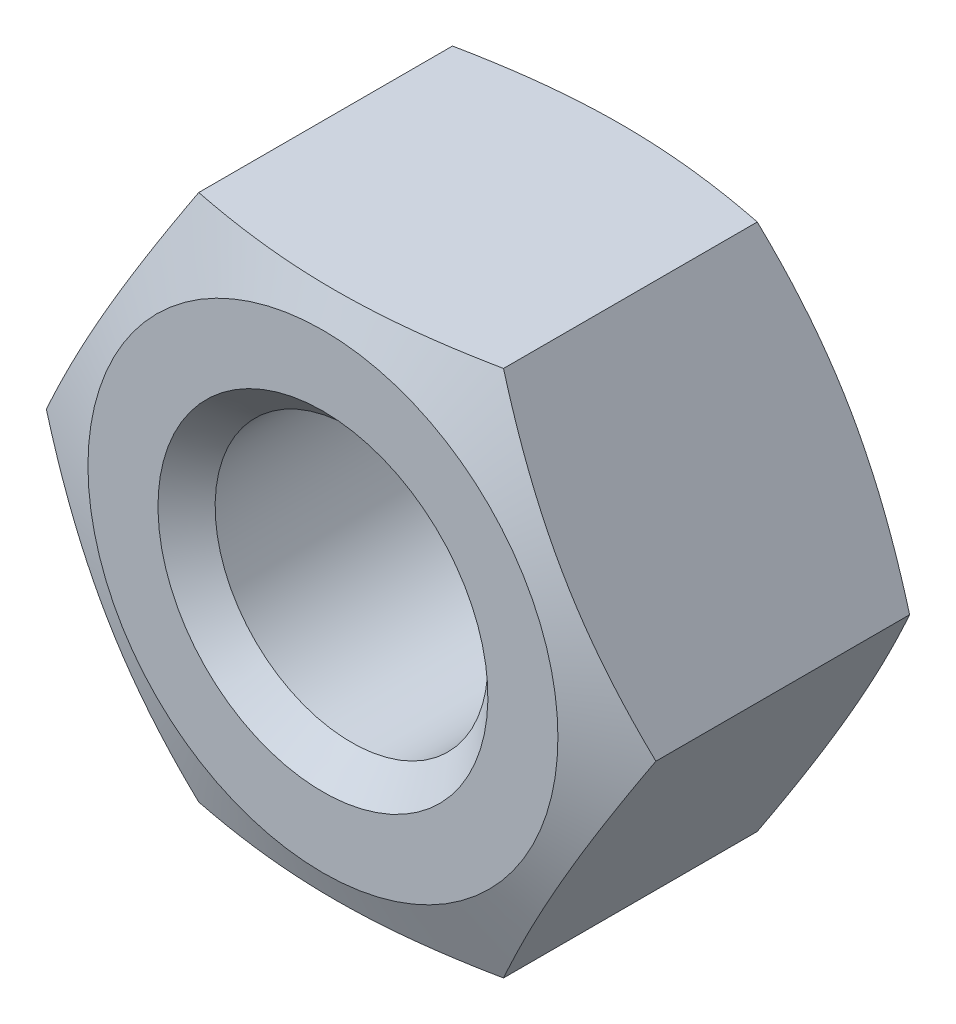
ISO-10303-21;
HEADER;
FILE_DESCRIPTION(('STEP AP214'),'2;1');
FILE_NAME('part.step','',(''),(''),'','','');
FILE_SCHEMA(('AUTOMOTIVE_DESIGN { 1 0 10303 214 1 1 1 1 }'));
ENDSEC;
DATA;
#1=APPLICATION_CONTEXT('core data for automotive mechanical design processes');
#2=APPLICATION_PROTOCOL_DEFINITION('international standard','automotive_design',2000,#1);
#3=PRODUCT_CONTEXT('',#1,'mechanical');
#4=PRODUCT('Part','Part','',(#3));
#5=PRODUCT_RELATED_PRODUCT_CATEGORY('part','',(#4));
#6=PRODUCT_DEFINITION_FORMATION('','',#4);
#7=PRODUCT_DEFINITION_CONTEXT('part definition',#1,'design');
#8=PRODUCT_DEFINITION('design','',#6,#7);
#9=PRODUCT_DEFINITION_SHAPE('','',#8);
#10=(LENGTH_UNIT() NAMED_UNIT(*) SI_UNIT(.MILLI.,.METRE.));
#11=(NAMED_UNIT(*) PLANE_ANGLE_UNIT() SI_UNIT($,.RADIAN.));
#12=(NAMED_UNIT(*) SI_UNIT($,.STERADIAN.) SOLID_ANGLE_UNIT());
#13=UNCERTAINTY_MEASURE_WITH_UNIT(LENGTH_MEASURE(1.E-05),#10,'distance_accuracy_value','');
#14=(GEOMETRIC_REPRESENTATION_CONTEXT(3) GLOBAL_UNCERTAINTY_ASSIGNED_CONTEXT((#13)) GLOBAL_UNIT_ASSIGNED_CONTEXT((#10,
#11,#12)) REPRESENTATION_CONTEXT('',''));
#15=CARTESIAN_POINT('',(0.,0.,0.));
#16=DIRECTION('',(0.,0.,1.));
#17=DIRECTION('',(1.,0.,0.));
#18=AXIS2_PLACEMENT_3D('',#15,#16,#17);
#19=CARTESIAN_POINT('',(4.6188,0.,4.7));
#20=DIRECTION('',(0.,0.,1.));
#21=DIRECTION('',(1.,0.,0.));
#22=AXIS2_PLACEMENT_3D('',#19,#20,#21);
#23=PLANE('',#22);
#24=CARTESIAN_POINT('',(0.,0.,4.7));
#25=DIRECTION('',(0.,0.,-1.));
#26=DIRECTION('',(0.,1.,0.));
#27=AXIS2_PLACEMENT_3D('',#24,#25,#26);
#28=CIRCLE('',#27,2.5);
#29=CARTESIAN_POINT('',(0.,2.5,4.7));
#30=VERTEX_POINT('',#29);
#31=EDGE_CURVE('E219',#30,#30,#28,.T.);
#32=ORIENTED_EDGE('',*,*,#31,.T.);
#33=EDGE_LOOP('',(#32));
#34=FACE_BOUND('',#33,.T.);
#35=CARTESIAN_POINT('',(0.,0.,4.7));
#36=DIRECTION('',(0.,0.,-1.));
#37=DIRECTION('',(0.,1.,0.));
#38=AXIS2_PLACEMENT_3D('',#35,#36,#37);
#39=CIRCLE('',#38,3.56126288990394);
#40=CARTESIAN_POINT('',(0.,3.56126288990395,4.7));
#41=VERTEX_POINT('',#40);
#42=EDGE_CURVE('E222',#41,#41,#39,.T.);
#43=ORIENTED_EDGE('',*,*,#42,.F.);
#44=EDGE_LOOP('',(#43));
#45=FACE_BOUND('',#44,.T.);
#46=ADVANCED_FACE('F16',(#34,#45),#23,.T.);
#47=CARTESIAN_POINT('',(0.,0.,4.7));
#48=DIRECTION('',(0.,0.,1.));
#49=DIRECTION('',(0.,-1.,0.));
#50=AXIS2_PLACEMENT_3D('',#47,#48,#49);
#51=CONICAL_SURFACE('',#50,2.5,0.785398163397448);
#52=CARTESIAN_POINT('',(0.,0.,4.267));
#53=DIRECTION('',(0.,0.,-1.));
#54=DIRECTION('',(0.,1.,0.));
#55=AXIS2_PLACEMENT_3D('',#52,#53,#54);
#56=CIRCLE('',#55,2.067);
#57=CARTESIAN_POINT('',(0.,2.067,4.267));
#58=VERTEX_POINT('',#57);
#59=EDGE_CURVE('E97',#58,#58,#56,.T.);
#60=ORIENTED_EDGE('',*,*,#59,.T.);
#61=EDGE_LOOP('',(#60));
#62=FACE_BOUND('',#61,.T.);
#63=ORIENTED_EDGE('',*,*,#31,.F.);
#64=EDGE_LOOP('',(#63));
#65=FACE_BOUND('',#64,.T.);
#66=ADVANCED_FACE('F145',(#62,#65),#51,.F.);
#67=CARTESIAN_POINT('',(0.,0.,0.));
#68=DIRECTION('',(0.,0.,-1.));
#69=DIRECTION('',(0.,1.,0.));
#70=AXIS2_PLACEMENT_3D('',#67,#68,#69);
#71=CYLINDRICAL_SURFACE('',#70,2.067);
#72=CARTESIAN_POINT('',(0.,0.,0.433));
#73=DIRECTION('',(0.,0.,-1.));
#74=DIRECTION('',(0.,1.,0.));
#75=AXIS2_PLACEMENT_3D('',#72,#73,#74);
#76=CIRCLE('',#75,2.067);
#77=CARTESIAN_POINT('',(0.,2.067,0.433));
#78=VERTEX_POINT('',#77);
#79=EDGE_CURVE('E94',#78,#78,#76,.T.);
#80=ORIENTED_EDGE('',*,*,#79,.T.);
#81=EDGE_LOOP('',(#80));
#82=FACE_BOUND('',#81,.T.);
#83=ORIENTED_EDGE('',*,*,#59,.F.);
#84=EDGE_LOOP('',(#83));
#85=FACE_BOUND('',#84,.T.);
#86=ADVANCED_FACE('F214',(#82,#85),#71,.F.);
#87=CARTESIAN_POINT('',(0.,0.,0.));
#88=DIRECTION('',(0.,0.,-1.));
#89=DIRECTION('',(0.,1.,0.));
#90=AXIS2_PLACEMENT_3D('',#87,#88,#89);
#91=CONICAL_SURFACE('',#90,2.5,0.785398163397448);
#92=ORIENTED_EDGE('',*,*,#79,.F.);
#93=EDGE_LOOP('',(#92));
#94=FACE_BOUND('',#93,.T.);
#95=CARTESIAN_POINT('',(0.,0.,0.));
#96=DIRECTION('',(0.,0.,-1.));
#97=DIRECTION('',(0.,1.,0.));
#98=AXIS2_PLACEMENT_3D('',#95,#96,#97);
#99=CIRCLE('',#98,2.5);
#100=CARTESIAN_POINT('',(0.,2.5,0.));
#101=VERTEX_POINT('',#100);
#102=EDGE_CURVE('E223',#101,#101,#99,.T.);
#103=ORIENTED_EDGE('',*,*,#102,.T.);
#104=EDGE_LOOP('',(#103));
#105=FACE_BOUND('',#104,.T.);
#106=ADVANCED_FACE('F143',(#94,#105),#91,.F.);
#107=CARTESIAN_POINT('',(0.,0.,4.27272727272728));
#108=DIRECTION('',(0.,0.,-1.));
#109=DIRECTION('',(0.,1.,0.));
#110=AXIS2_PLACEMENT_3D('',#107,#108,#109);
#111=CONICAL_SURFACE('',#110,4.6188,1.18682389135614);
#112=ORIENTED_EDGE('',*,*,#42,.T.);
#113=EDGE_LOOP('',(#112));
#114=FACE_BOUND('',#113,.T.);
#115=CARTESIAN_POINT('',(-6.09930995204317,-3.99999813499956,3.19190038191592));
#116=CARTESIAN_POINT('',(-5.91892963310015,-3.99999813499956,3.25282504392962));
#117=CARTESIAN_POINT('',(-5.7383089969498,-3.99999813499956,3.31305134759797));
#118=CARTESIAN_POINT('',(-5.37646274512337,-3.99999813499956,3.43171699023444));
#119=CARTESIAN_POINT('',(-5.19523707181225,-3.99999813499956,3.49015615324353));
#120=CARTESIAN_POINT('',(-4.8316520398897,-3.99999813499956,3.60498402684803));
#121=CARTESIAN_POINT('',(-4.64929099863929,-3.99999813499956,3.66136742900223));
#122=CARTESIAN_POINT('',(-4.28374430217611,-3.99999813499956,3.77138896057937));
#123=CARTESIAN_POINT('',(-4.10055866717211,-3.99999813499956,3.82502715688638));
#124=CARTESIAN_POINT('',(-3.73560267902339,-3.99999813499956,3.92819112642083));
#125=CARTESIAN_POINT('',(-3.55384495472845,-3.99999813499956,3.97776135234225));
#126=CARTESIAN_POINT('',(-3.18923639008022,-3.99999813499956,4.07270145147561));
#127=CARTESIAN_POINT('',(-3.00638559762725,-3.99999813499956,4.11807150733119));
#128=CARTESIAN_POINT('',(-2.63954564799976,-3.99999813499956,4.2035308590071));
#129=CARTESIAN_POINT('',(-2.4555571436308,-3.99999813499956,4.24362293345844));
#130=CARTESIAN_POINT('',(-2.08627284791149,-3.99999813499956,4.3172829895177));
#131=CARTESIAN_POINT('',(-1.9009771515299,-3.99999813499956,4.35085144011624));
#132=CARTESIAN_POINT('',(-1.56714062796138,-3.99999813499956,4.40400152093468));
#133=CARTESIAN_POINT('',(-1.41883286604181,-3.99999813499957,4.42503961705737));
#134=CARTESIAN_POINT('',(-1.12152123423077,-3.99999813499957,4.4613933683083));
#135=CARTESIAN_POINT('',(-0.97251742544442,-3.99999813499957,4.47670951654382));
#136=CARTESIAN_POINT('',(-0.674080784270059,-3.99999813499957,4.50101509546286));
#137=CARTESIAN_POINT('',(-0.524648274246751,-3.99999813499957,4.51000843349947));
#138=CARTESIAN_POINT('',(-0.225527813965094,-3.99999813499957,4.52129085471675));
#139=CARTESIAN_POINT('',(-0.0758398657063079,-3.99999813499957,4.52357999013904));
#140=CARTESIAN_POINT('',(0.224222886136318,-3.99999813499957,4.52134300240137));
#141=CARTESIAN_POINT('',(0.374597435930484,-3.99999813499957,4.51678320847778));
#142=CARTESIAN_POINT('',(0.674993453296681,-3.99999813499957,4.50099613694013));
#143=CARTESIAN_POINT('',(0.825014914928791,-3.99999813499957,4.48976874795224));
#144=CARTESIAN_POINT('',(1.12455426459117,-3.99999813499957,4.46111734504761));
#145=CARTESIAN_POINT('',(1.2740717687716,-3.99999813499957,4.44368936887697));
#146=CARTESIAN_POINT('',(1.57234656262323,-3.99999813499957,4.40329323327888));
#147=CARTESIAN_POINT('',(1.72110385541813,-3.99999813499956,4.38032509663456));
#148=CARTESIAN_POINT('',(2.04453662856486,-3.99999813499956,4.3249980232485));
#149=CARTESIAN_POINT('',(2.21904917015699,-3.99999813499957,4.29169256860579));
#150=CARTESIAN_POINT('',(2.56692686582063,-3.99999813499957,4.21953597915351));
#151=CARTESIAN_POINT('',(2.74029191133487,-3.99999813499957,4.1806843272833));
#152=CARTESIAN_POINT('',(3.08603228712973,-3.99999813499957,4.09844952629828));
#153=CARTESIAN_POINT('',(3.25840704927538,-3.99999813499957,4.05506400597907));
#154=CARTESIAN_POINT('',(3.60218429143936,-3.99999813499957,3.96464576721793));
#155=CARTESIAN_POINT('',(3.77358680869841,-3.99999813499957,3.91761318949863));
#156=CARTESIAN_POINT('',(4.11600883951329,-3.99999813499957,3.82047195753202));
#157=CARTESIAN_POINT('',(4.28702610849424,-3.99999813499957,3.77035542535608));
#158=CARTESIAN_POINT('',(4.6283378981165,-3.99999813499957,3.66771724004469));
#159=CARTESIAN_POINT('',(4.79863240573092,-3.99999813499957,3.61519554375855));
#160=CARTESIAN_POINT('',(5.30849612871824,-3.99999813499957,3.45474581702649));
#161=CARTESIAN_POINT('',(5.64714738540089,-3.99999813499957,3.34390364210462));
#162=CARTESIAN_POINT('',(6.32026754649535,-3.99999813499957,3.11778491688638));
#163=CARTESIAN_POINT('',(6.65474906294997,-3.99999813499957,3.00254554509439));
#164=CARTESIAN_POINT('',(7.32245607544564,-3.99999813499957,2.76840994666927));
#165=CARTESIAN_POINT('',(7.65568147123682,-3.99999813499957,2.64951343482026));
#166=CARTESIAN_POINT('',(8.31894946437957,-3.99999813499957,2.40989981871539));
#167=CARTESIAN_POINT('',(8.64899842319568,-3.99999813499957,2.28920026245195));
#168=CARTESIAN_POINT('',(9.30832685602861,-3.99999813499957,2.04584645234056));
#169=CARTESIAN_POINT('',(9.6376064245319,-3.99999813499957,1.92319245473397));
#170=CARTESIAN_POINT('',(9.96662914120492,-3.99999813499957,1.79986374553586));
#171=B_SPLINE_CURVE_WITH_KNOTS('',3,(#115,#116,#117,#118,#119,#120,#121,#122,#123,#124,#125,
#126,#127,#128,#129,#130,#131,#132,#133,#134,#135,#136,#137,#138,#139,#140,#141,#142,#143,#144,
#145,#146,#147,#148,#149,#150,#151,#152,#153,#154,#155,#156,#157,#158,#159,#160,#161,#162,#163,
#164,#165,#166,#167,#168,#169,#170),.UNSPECIFIED.,.F.,.F.,(4,2,2,2,2,2,2,2,2,2,2,2,2,2,2,2,2,2,
2,2,2,2,2,2,2,2,2,4),(0.,0.571178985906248,1.1424140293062,1.71503246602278,2.28763694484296,
2.85278575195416,3.41790997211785,3.98273547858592,4.54752036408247,4.99680205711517,
5.446045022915,5.89501012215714,6.34397172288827,6.79514774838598,7.24633131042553,
7.6978037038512,8.14927424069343,8.68214772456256,9.2150709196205,9.7482742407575,
10.2814569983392,10.8160633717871,11.3506793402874,12.4195932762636,13.4808989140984,
14.542287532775,15.5965608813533,16.6506971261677),.UNSPECIFIED.);
#172=CARTESIAN_POINT('',(-2.3094,-3.99999813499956,4.27272727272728));
#173=VERTEX_POINT('',#172);
#174=CARTESIAN_POINT('',(2.3094,-3.99999813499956,4.27272727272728));
#175=VERTEX_POINT('',#174);
#176=EDGE_CURVE('E77',#173,#175,#171,.T.);
#177=ORIENTED_EDGE('',*,*,#176,.T.);
#178=CARTESIAN_POINT('',(2.30939988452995,-3.99999833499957,4.27272722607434));
#179=CARTESIAN_POINT('',(2.39008408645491,-3.86024919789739,4.30532763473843));
#180=CARTESIAN_POINT('',(2.47103459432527,-3.72003880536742,4.33547195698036));
#181=CARTESIAN_POINT('',(2.63347088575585,-3.43869089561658,4.38992193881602));
#182=CARTESIAN_POINT('',(2.71495695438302,-3.29755288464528,4.41422417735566));
#183=CARTESIAN_POINT('',(2.8783483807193,-3.0145506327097,4.45601699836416));
#184=CARTESIAN_POINT('',(2.96025360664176,-2.8726866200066,4.4735096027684));
#185=CARTESIAN_POINT('',(3.12436830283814,-2.58843162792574,4.5008725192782));
#186=CARTESIAN_POINT('',(3.20657770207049,-2.44604077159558,4.5107445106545));
#187=CARTESIAN_POINT('',(3.36974497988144,-2.16342675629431,4.52225230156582));
#188=CARTESIAN_POINT('',(3.4507004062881,-2.02320784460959,4.52402510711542));
#189=CARTESIAN_POINT('',(3.61256341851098,-1.7428528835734,4.51961174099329));
#190=CARTESIAN_POINT('',(3.69347099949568,-1.60271684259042,4.51342486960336));
#191=CARTESIAN_POINT('',(3.85498924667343,-1.32295903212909,4.49342532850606));
#192=CARTESIAN_POINT('',(3.93560007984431,-1.18333697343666,4.47961794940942));
#193=CARTESIAN_POINT('',(4.09644627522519,-0.904743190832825,4.44504474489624));
#194=CARTESIAN_POINT('',(4.17668163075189,-0.765771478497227,4.424278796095));
#195=CARTESIAN_POINT('',(4.28694558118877,-0.574788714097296,4.39145407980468));
#196=CARTESIAN_POINT('',(4.31717509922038,-0.522429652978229,4.38200859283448));
#197=CARTESIAN_POINT('',(4.37756278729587,-0.417835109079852,4.36229510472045));
#198=CARTESIAN_POINT('',(4.40772096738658,-0.365599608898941,4.35202722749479));
#199=CARTESIAN_POINT('',(4.46807171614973,-0.261069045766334,4.33067991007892));
#200=CARTESIAN_POINT('',(4.49826404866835,-0.208774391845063,4.31959781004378));
#201=CARTESIAN_POINT('',(4.55858256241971,-0.104299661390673,4.29670026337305));
#202=CARTESIAN_POINT('',(4.58870873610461,-0.0521195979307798,4.2848847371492));
#203=CARTESIAN_POINT('',(4.61880011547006,1.99999999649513E-07,4.27272722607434));
#204=B_SPLINE_CURVE_WITH_KNOTS('',3,(#178,#179,#180,#181,#182,#183,#184,#185,#186,#187,#188,
#189,#190,#191,#192,#193,#194,#195,#196,#197,#198,#199,#200,#201,#202,#203),.UNSPECIFIED.,.F.,
.F.,(4,2,2,2,2,2,2,2,2,2,2,2,4),(0.,0.493920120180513,0.988128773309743,1.48219057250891,
1.97614346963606,2.46170893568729,2.94731708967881,3.43258852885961,3.91786857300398,
4.10144236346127,4.28498854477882,4.46916354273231,4.65335856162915),.UNSPECIFIED.);
#205=CARTESIAN_POINT('',(4.6188,0.,4.27272727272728));
#206=VERTEX_POINT('',#205);
#207=EDGE_CURVE('E170',#175,#206,#204,.T.);
#208=ORIENTED_EDGE('',*,*,#207,.T.);
#209=CARTESIAN_POINT('',(4.61880011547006,-2.00000000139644E-07,4.27272722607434));
#210=CARTESIAN_POINT('',(4.53811591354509,0.139748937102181,4.30532763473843));
#211=CARTESIAN_POINT('',(4.45716540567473,0.279959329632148,4.33547195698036));
#212=CARTESIAN_POINT('',(4.29472911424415,0.561307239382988,4.38992193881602));
#213=CARTESIAN_POINT('',(4.21324304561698,0.702445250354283,4.41422417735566));
#214=CARTESIAN_POINT('',(4.0498516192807,0.985447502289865,4.45601699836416));
#215=CARTESIAN_POINT('',(3.96794639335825,1.12731151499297,4.4735096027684));
#216=CARTESIAN_POINT('',(3.80383169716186,1.41156650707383,4.5008725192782));
#217=CARTESIAN_POINT('',(3.72162229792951,1.55395736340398,4.5107445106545));
#218=CARTESIAN_POINT('',(3.55845502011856,1.83657137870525,4.52225230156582));
#219=CARTESIAN_POINT('',(3.47749959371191,1.97679029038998,4.52402510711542));
#220=CARTESIAN_POINT('',(3.31563658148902,2.25714525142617,4.51961174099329));
#221=CARTESIAN_POINT('',(3.23472900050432,2.39728129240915,4.51342486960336));
#222=CARTESIAN_POINT('',(3.07321075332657,2.67703910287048,4.49342532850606));
#223=CARTESIAN_POINT('',(2.99259992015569,2.81666116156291,4.47961794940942));
#224=CARTESIAN_POINT('',(2.83175372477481,3.09525494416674,4.44504474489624));
#225=CARTESIAN_POINT('',(2.75151836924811,3.23422665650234,4.424278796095));
#226=CARTESIAN_POINT('',(2.64125441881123,3.42520942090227,4.39145407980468));
#227=CARTESIAN_POINT('',(2.61102490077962,3.47756848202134,4.38200859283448));
#228=CARTESIAN_POINT('',(2.55063721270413,3.58216302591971,4.36229510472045));
#229=CARTESIAN_POINT('',(2.52047903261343,3.63439852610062,4.35202722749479));
#230=CARTESIAN_POINT('',(2.46012828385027,3.73892908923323,4.33067991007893));
#231=CARTESIAN_POINT('',(2.42993595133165,3.7912237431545,4.31959781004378));
#232=CARTESIAN_POINT('',(2.36961743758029,3.89569847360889,4.29670026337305));
#233=CARTESIAN_POINT('',(2.33949126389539,3.94787853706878,4.2848847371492));
#234=CARTESIAN_POINT('',(2.30939988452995,3.99999833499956,4.27272722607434));
#235=B_SPLINE_CURVE_WITH_KNOTS('',3,(#209,#210,#211,#212,#213,#214,#215,#216,#217,#218,#219,
#220,#221,#222,#223,#224,#225,#226,#227,#228,#229,#230,#231,#232,#233,#234),.UNSPECIFIED.,.F.,
.F.,(4,2,2,2,2,2,2,2,2,2,2,2,4),(0.,0.493920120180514,0.988128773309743,1.48219057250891,
1.97614346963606,2.46170893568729,2.94731708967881,3.43258852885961,3.91786857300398,
4.10144236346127,4.28498854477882,4.46916354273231,4.65335856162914),.UNSPECIFIED.);
#236=CARTESIAN_POINT('',(2.3094,3.99999813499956,4.27272727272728));
#237=VERTEX_POINT('',#236);
#238=EDGE_CURVE('E39',#206,#237,#235,.T.);
#239=ORIENTED_EDGE('',*,*,#238,.T.);
#240=CARTESIAN_POINT('',(-6.09930995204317,3.99999813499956,3.19190038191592));
#241=CARTESIAN_POINT('',(-5.91892963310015,3.99999813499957,3.25282504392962));
#242=CARTESIAN_POINT('',(-5.7383089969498,3.99999813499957,3.31305134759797));
#243=CARTESIAN_POINT('',(-5.37646274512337,3.99999813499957,3.43171699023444));
#244=CARTESIAN_POINT('',(-5.19523707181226,3.99999813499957,3.49015615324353));
#245=CARTESIAN_POINT('',(-4.8316520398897,3.99999813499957,3.60498402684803));
#246=CARTESIAN_POINT('',(-4.64929099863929,3.99999813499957,3.66136742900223));
#247=CARTESIAN_POINT('',(-4.28374430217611,3.99999813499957,3.77138896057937));
#248=CARTESIAN_POINT('',(-4.10055866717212,3.99999813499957,3.82502715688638));
#249=CARTESIAN_POINT('',(-3.73560267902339,3.99999813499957,3.92819112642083));
#250=CARTESIAN_POINT('',(-3.55384495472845,3.99999813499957,3.97776135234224));
#251=CARTESIAN_POINT('',(-3.18923639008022,3.99999813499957,4.07270145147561));
#252=CARTESIAN_POINT('',(-3.00638559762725,3.99999813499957,4.11807150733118));
#253=CARTESIAN_POINT('',(-2.63954564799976,3.99999813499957,4.2035308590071));
#254=CARTESIAN_POINT('',(-2.45555714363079,3.99999813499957,4.24362293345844));
#255=CARTESIAN_POINT('',(-2.08627284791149,3.99999813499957,4.3172829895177));
#256=CARTESIAN_POINT('',(-1.90097715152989,3.99999813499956,4.35085144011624));
#257=CARTESIAN_POINT('',(-1.56714062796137,3.99999813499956,4.40400152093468));
#258=CARTESIAN_POINT('',(-1.41883286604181,3.99999813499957,4.42503961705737));
#259=CARTESIAN_POINT('',(-1.12152123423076,3.99999813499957,4.4613933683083));
#260=CARTESIAN_POINT('',(-0.972517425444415,3.99999813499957,4.47670951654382));
#261=CARTESIAN_POINT('',(-0.674080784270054,3.99999813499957,4.50101509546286));
#262=CARTESIAN_POINT('',(-0.524648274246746,3.99999813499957,4.51000843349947));
#263=CARTESIAN_POINT('',(-0.225527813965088,3.99999813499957,4.52129085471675));
#264=CARTESIAN_POINT('',(-0.0758398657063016,3.99999813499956,4.52357999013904));
#265=CARTESIAN_POINT('',(0.224222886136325,3.99999813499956,4.52134300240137));
#266=CARTESIAN_POINT('',(0.374597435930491,3.99999813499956,4.51678320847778));
#267=CARTESIAN_POINT('',(0.674993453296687,3.99999813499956,4.50099613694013));
#268=CARTESIAN_POINT('',(0.825014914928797,3.99999813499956,4.48976874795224));
#269=CARTESIAN_POINT('',(1.12455426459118,3.99999813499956,4.46111734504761));
#270=CARTESIAN_POINT('',(1.2740717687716,3.99999813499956,4.44368936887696));
#271=CARTESIAN_POINT('',(1.57234656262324,3.99999813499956,4.40329323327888));
#272=CARTESIAN_POINT('',(1.72110385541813,3.99999813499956,4.38032509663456));
#273=CARTESIAN_POINT('',(2.04453662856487,3.99999813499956,4.32499802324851));
#274=CARTESIAN_POINT('',(2.21904917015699,3.99999813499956,4.29169256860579));
#275=CARTESIAN_POINT('',(2.56692686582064,3.99999813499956,4.21953597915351));
#276=CARTESIAN_POINT('',(2.74029191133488,3.99999813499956,4.1806843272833));
#277=CARTESIAN_POINT('',(3.08603228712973,3.99999813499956,4.09844952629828));
#278=CARTESIAN_POINT('',(3.25840704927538,3.99999813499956,4.05506400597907));
#279=CARTESIAN_POINT('',(3.60218429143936,3.99999813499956,3.96464576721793));
#280=CARTESIAN_POINT('',(3.77358680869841,3.99999813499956,3.91761318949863));
#281=CARTESIAN_POINT('',(4.11600883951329,3.99999813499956,3.82047195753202));
#282=CARTESIAN_POINT('',(4.28702610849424,3.99999813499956,3.77035542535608));
#283=CARTESIAN_POINT('',(4.6283378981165,3.99999813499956,3.66771724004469));
#284=CARTESIAN_POINT('',(4.79863240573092,3.99999813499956,3.61519554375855));
#285=CARTESIAN_POINT('',(5.30849612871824,3.99999813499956,3.45474581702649));
#286=CARTESIAN_POINT('',(5.64714738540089,3.99999813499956,3.34390364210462));
#287=CARTESIAN_POINT('',(6.32026754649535,3.99999813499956,3.11778491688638));
#288=CARTESIAN_POINT('',(6.65474906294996,3.99999813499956,3.00254554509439));
#289=CARTESIAN_POINT('',(7.32245607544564,3.99999813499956,2.76840994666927));
#290=CARTESIAN_POINT('',(7.65568147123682,3.99999813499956,2.64951343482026));
#291=CARTESIAN_POINT('',(8.31894946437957,3.99999813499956,2.40989981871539));
#292=CARTESIAN_POINT('',(8.64899842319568,3.99999813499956,2.28920026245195));
#293=CARTESIAN_POINT('',(9.30832685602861,3.99999813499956,2.04584645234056));
#294=CARTESIAN_POINT('',(9.6376064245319,3.99999813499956,1.92319245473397));
#295=CARTESIAN_POINT('',(9.96662914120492,3.99999813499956,1.79986374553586));
#296=B_SPLINE_CURVE_WITH_KNOTS('',3,(#240,#241,#242,#243,#244,#245,#246,#247,#248,#249,#250,
#251,#252,#253,#254,#255,#256,#257,#258,#259,#260,#261,#262,#263,#264,#265,#266,#267,#268,#269,
#270,#271,#272,#273,#274,#275,#276,#277,#278,#279,#280,#281,#282,#283,#284,#285,#286,#287,#288,
#289,#290,#291,#292,#293,#294,#295),.UNSPECIFIED.,.F.,.F.,(4,2,2,2,2,2,2,2,2,2,2,2,2,2,2,2,2,2,
2,2,2,2,2,2,2,2,2,4),(0.,0.571178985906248,1.1424140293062,1.71503246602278,2.28763694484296,
2.85278575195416,3.41790997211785,3.98273547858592,4.54752036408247,4.99680205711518,
5.44604502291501,5.89501012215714,6.34397172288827,6.79514774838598,7.24633131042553,
7.6978037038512,8.14927424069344,8.68214772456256,9.21507091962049,9.74827424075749,
10.2814569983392,10.8160633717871,11.3506793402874,12.4195932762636,13.4808989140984,
14.542287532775,15.5965608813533,16.6506971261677),.UNSPECIFIED.);
#297=CARTESIAN_POINT('',(-2.3094,3.99999813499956,4.27272727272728));
#298=VERTEX_POINT('',#297);
#299=EDGE_CURVE('E159',#237,#298,#296,.F.);
#300=ORIENTED_EDGE('',*,*,#299,.T.);
#301=CARTESIAN_POINT('',(-2.30939988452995,3.99999833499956,4.27272722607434));
#302=CARTESIAN_POINT('',(-2.39008408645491,3.86024919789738,4.30532763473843));
#303=CARTESIAN_POINT('',(-2.47103459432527,3.72003880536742,4.33547195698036));
#304=CARTESIAN_POINT('',(-2.63347088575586,3.43869089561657,4.38992193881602));
#305=CARTESIAN_POINT('',(-2.71495695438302,3.29755288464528,4.41422417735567));
#306=CARTESIAN_POINT('',(-2.8783483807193,3.0145506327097,4.45601699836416));
#307=CARTESIAN_POINT('',(-2.96025360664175,2.8726866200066,4.4735096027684));
#308=CARTESIAN_POINT('',(-3.12436830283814,2.58843162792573,4.5008725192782));
#309=CARTESIAN_POINT('',(-3.20657770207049,2.44604077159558,4.5107445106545));
#310=CARTESIAN_POINT('',(-3.36974497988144,2.16342675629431,4.52225230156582));
#311=CARTESIAN_POINT('',(-3.45070040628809,2.02320784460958,4.52402510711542));
#312=CARTESIAN_POINT('',(-3.61256341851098,1.7428528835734,4.51961174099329));
#313=CARTESIAN_POINT('',(-3.69347099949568,1.60271684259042,4.51342486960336));
#314=CARTESIAN_POINT('',(-3.85498924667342,1.32295903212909,4.49342532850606));
#315=CARTESIAN_POINT('',(-3.93560007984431,1.18333697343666,4.47961794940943));
#316=CARTESIAN_POINT('',(-4.09644627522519,0.904743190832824,4.44504474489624));
#317=CARTESIAN_POINT('',(-4.17668163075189,0.76577147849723,4.424278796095));
#318=CARTESIAN_POINT('',(-4.28694558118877,0.574788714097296,4.39145407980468));
#319=CARTESIAN_POINT('',(-4.31717509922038,0.522429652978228,4.38200859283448));
#320=CARTESIAN_POINT('',(-4.37756278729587,0.417835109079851,4.36229510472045));
#321=CARTESIAN_POINT('',(-4.40772096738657,0.365599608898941,4.35202722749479));
#322=CARTESIAN_POINT('',(-4.46807171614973,0.261069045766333,4.33067991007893));
#323=CARTESIAN_POINT('',(-4.49826404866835,0.208774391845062,4.31959781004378));
#324=CARTESIAN_POINT('',(-4.55858256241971,0.104299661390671,4.29670026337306));
#325=CARTESIAN_POINT('',(-4.58870873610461,0.0521195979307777,4.2848847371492));
#326=CARTESIAN_POINT('',(-4.61880011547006,-2.00000001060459E-07,4.27272722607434));
#327=B_SPLINE_CURVE_WITH_KNOTS('',3,(#301,#302,#303,#304,#305,#306,#307,#308,#309,#310,#311,
#312,#313,#314,#315,#316,#317,#318,#319,#320,#321,#322,#323,#324,#325,#326),.UNSPECIFIED.,.F.,
.F.,(4,2,2,2,2,2,2,2,2,2,2,2,4),(0.,0.493920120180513,0.988128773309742,1.4821905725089,
1.97614346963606,2.46170893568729,2.94731708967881,3.43258852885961,3.91786857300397,
4.10144236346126,4.28498854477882,4.46916354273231,4.65335856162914),.UNSPECIFIED.);
#328=CARTESIAN_POINT('',(-4.6188,0.,4.27272727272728));
#329=VERTEX_POINT('',#328);
#330=EDGE_CURVE('E153',#298,#329,#327,.T.);
#331=ORIENTED_EDGE('',*,*,#330,.T.);
#332=CARTESIAN_POINT('',(-4.61880011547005,1.99999998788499E-07,4.27272722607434));
#333=CARTESIAN_POINT('',(-4.53811591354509,-0.139748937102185,4.30532763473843));
#334=CARTESIAN_POINT('',(-4.45716540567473,-0.279959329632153,4.33547195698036));
#335=CARTESIAN_POINT('',(-4.29472911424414,-0.561307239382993,4.38992193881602));
#336=CARTESIAN_POINT('',(-4.21324304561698,-0.702445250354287,4.41422417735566));
#337=CARTESIAN_POINT('',(-4.0498516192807,-0.985447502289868,4.45601699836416));
#338=CARTESIAN_POINT('',(-3.96794639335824,-1.12731151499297,4.4735096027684));
#339=CARTESIAN_POINT('',(-3.80383169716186,-1.41156650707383,4.5008725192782));
#340=CARTESIAN_POINT('',(-3.72162229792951,-1.55395736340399,4.5107445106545));
#341=CARTESIAN_POINT('',(-3.55845502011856,-1.83657137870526,4.52225230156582));
#342=CARTESIAN_POINT('',(-3.47749959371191,-1.97679029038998,4.52402510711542));
#343=CARTESIAN_POINT('',(-3.31563658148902,-2.25714525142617,4.51961174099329));
#344=CARTESIAN_POINT('',(-3.23472900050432,-2.39728129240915,4.51342486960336));
#345=CARTESIAN_POINT('',(-3.07321075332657,-2.67703910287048,4.49342532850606));
#346=CARTESIAN_POINT('',(-2.99259992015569,-2.81666116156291,4.47961794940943));
#347=CARTESIAN_POINT('',(-2.83175372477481,-3.09525494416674,4.44504474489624));
#348=CARTESIAN_POINT('',(-2.75151836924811,-3.23422665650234,4.424278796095));
#349=CARTESIAN_POINT('',(-2.64125441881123,-3.42520942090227,4.39145407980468));
#350=CARTESIAN_POINT('',(-2.61102490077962,-3.47756848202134,4.38200859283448));
#351=CARTESIAN_POINT('',(-2.55063721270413,-3.58216302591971,4.36229510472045));
#352=CARTESIAN_POINT('',(-2.52047903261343,-3.63439852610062,4.35202722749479));
#353=CARTESIAN_POINT('',(-2.46012828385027,-3.73892908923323,4.33067991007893));
#354=CARTESIAN_POINT('',(-2.42993595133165,-3.7912237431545,4.31959781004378));
#355=CARTESIAN_POINT('',(-2.36961743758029,-3.89569847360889,4.29670026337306));
#356=CARTESIAN_POINT('',(-2.33949126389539,-3.94787853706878,4.2848847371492));
#357=CARTESIAN_POINT('',(-2.30939988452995,-3.99999833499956,4.27272722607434));
#358=B_SPLINE_CURVE_WITH_KNOTS('',3,(#332,#333,#334,#335,#336,#337,#338,#339,#340,#341,#342,
#343,#344,#345,#346,#347,#348,#349,#350,#351,#352,#353,#354,#355,#356,#357),.UNSPECIFIED.,.F.,
.F.,(4,2,2,2,2,2,2,2,2,2,2,2,4),(0.,0.493920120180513,0.988128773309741,1.4821905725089,
1.97614346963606,2.46170893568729,2.94731708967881,3.43258852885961,3.91786857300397,
4.10144236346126,4.28498854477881,4.4691635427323,4.65335856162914),.UNSPECIFIED.);
#359=EDGE_CURVE('E128',#329,#173,#358,.T.);
#360=ORIENTED_EDGE('',*,*,#359,.T.);
#361=EDGE_LOOP('',(#177,#208,#239,#300,#331,#360));
#362=FACE_BOUND('',#361,.T.);
#363=ADVANCED_FACE('F139',(#114,#362),#111,.T.);
#364=CARTESIAN_POINT('',(2.3094,-3.99999813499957,4.7));
#365=DIRECTION('',(-0.866025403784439,0.5,0.));
#366=DIRECTION('',(-0.5,-0.866025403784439,0.));
#367=AXIS2_PLACEMENT_3D('',#364,#365,#366);
#368=PLANE('',#367);
#369=ORIENTED_EDGE('',*,*,#207,.F.);
#370=DIRECTION('',(0.,0.,-1.));
#371=VECTOR('',#370,1.);
#372=CARTESIAN_POINT('',(2.3094,-3.99999813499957,4.7));
#373=LINE('',#372,#371);
#374=CARTESIAN_POINT('',(2.3094,-3.99999813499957,0.427272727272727));
#375=VERTEX_POINT('',#374);
#376=EDGE_CURVE('E81',#175,#375,#373,.T.);
#377=ORIENTED_EDGE('',*,*,#376,.T.);
#378=CARTESIAN_POINT('',(4.61880011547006,2.E-07,0.42727277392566));
#379=CARTESIAN_POINT('',(4.53811591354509,-0.139748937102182,0.394672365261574));
#380=CARTESIAN_POINT('',(4.45716540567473,-0.279959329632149,0.364528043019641));
#381=CARTESIAN_POINT('',(4.29472911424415,-0.561307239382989,0.310078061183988));
#382=CARTESIAN_POINT('',(4.21324304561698,-0.702445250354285,0.28577582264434));
#383=CARTESIAN_POINT('',(4.0498516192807,-0.985447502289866,0.243983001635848));
#384=CARTESIAN_POINT('',(3.96794639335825,-1.12731151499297,0.226490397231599));
#385=CARTESIAN_POINT('',(3.80383169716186,-1.41156650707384,0.1991274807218));
#386=CARTESIAN_POINT('',(3.72162229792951,-1.55395736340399,0.189255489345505));
#387=CARTESIAN_POINT('',(3.55845502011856,-1.83657137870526,0.177747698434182));
#388=CARTESIAN_POINT('',(3.47749959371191,-1.97679029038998,0.175974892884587));
#389=CARTESIAN_POINT('',(3.31563658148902,-2.25714525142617,0.180388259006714));
#390=CARTESIAN_POINT('',(3.23472900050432,-2.39728129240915,0.186575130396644));
#391=CARTESIAN_POINT('',(3.07321075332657,-2.67703910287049,0.206574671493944));
#392=CARTESIAN_POINT('',(2.99259992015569,-2.81666116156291,0.220382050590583));
#393=CARTESIAN_POINT('',(2.83175372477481,-3.09525494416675,0.254955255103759));
#394=CARTESIAN_POINT('',(2.75151836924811,-3.23422665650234,0.275721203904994));
#395=CARTESIAN_POINT('',(2.64125441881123,-3.42520942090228,0.30854592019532));
#396=CARTESIAN_POINT('',(2.61102490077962,-3.47756848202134,0.317991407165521));
#397=CARTESIAN_POINT('',(2.55063721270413,-3.58216302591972,0.33770489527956));
#398=CARTESIAN_POINT('',(2.52047903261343,-3.63439852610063,0.347972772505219));
#399=CARTESIAN_POINT('',(2.46012828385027,-3.73892908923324,0.36932008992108));
#400=CARTESIAN_POINT('',(2.42993595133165,-3.79122374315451,0.38040218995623));
#401=CARTESIAN_POINT('',(2.36961743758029,-3.8956984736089,0.40329973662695));
#402=CARTESIAN_POINT('',(2.33949126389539,-3.94787853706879,0.415115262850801));
#403=CARTESIAN_POINT('',(2.30939988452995,-3.99999833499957,0.42727277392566));
#404=B_SPLINE_CURVE_WITH_KNOTS('',3,(#378,#379,#380,#381,#382,#383,#384,#385,#386,#387,#388,
#389,#390,#391,#392,#393,#394,#395,#396,#397,#398,#399,#400,#401,#402,#403),.UNSPECIFIED.,.F.,
.F.,(4,2,2,2,2,2,2,2,2,2,2,2,4),(0.,0.493920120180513,0.988128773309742,1.48219057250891,
1.97614346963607,2.4617089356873,2.94731708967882,3.43258852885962,3.91786857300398,
4.10144236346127,4.28498854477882,4.46916354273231,4.65335856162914),.UNSPECIFIED.);
#405=CARTESIAN_POINT('',(4.6188,0.,0.427272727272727));
#406=VERTEX_POINT('',#405);
#407=EDGE_CURVE('E32',#406,#375,#404,.T.);
#408=ORIENTED_EDGE('',*,*,#407,.F.);
#409=DIRECTION('',(0.,0.,-1.));
#410=VECTOR('',#409,1.);
#411=CARTESIAN_POINT('',(4.6188,0.,4.7));
#412=LINE('',#411,#410);
#413=EDGE_CURVE('E25',#206,#406,#412,.T.);
#414=ORIENTED_EDGE('',*,*,#413,.F.);
#415=EDGE_LOOP('',(#369,#377,#408,#414));
#416=FACE_BOUND('',#415,.T.);
#417=ADVANCED_FACE('F18',(#416),#368,.F.);
#418=CARTESIAN_POINT('',(4.6188,0.,4.7));
#419=DIRECTION('',(-0.866025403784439,-0.5,0.));
#420=DIRECTION('',(0.5,-0.866025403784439,0.));
#421=AXIS2_PLACEMENT_3D('',#418,#419,#420);
#422=PLANE('',#421);
#423=ORIENTED_EDGE('',*,*,#238,.F.);
#424=ORIENTED_EDGE('',*,*,#413,.T.);
#425=CARTESIAN_POINT('',(2.30939988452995,3.99999833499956,0.427272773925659));
#426=CARTESIAN_POINT('',(2.39008408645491,3.86024919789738,0.394672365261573));
#427=CARTESIAN_POINT('',(2.47103459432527,3.72003880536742,0.364528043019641));
#428=CARTESIAN_POINT('',(2.63347088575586,3.43869089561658,0.310078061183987));
#429=CARTESIAN_POINT('',(2.71495695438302,3.29755288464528,0.285775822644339));
#430=CARTESIAN_POINT('',(2.8783483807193,3.0145506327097,0.243983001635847));
#431=CARTESIAN_POINT('',(2.96025360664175,2.8726866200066,0.226490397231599));
#432=CARTESIAN_POINT('',(3.12436830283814,2.58843162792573,0.199127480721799));
#433=CARTESIAN_POINT('',(3.20657770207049,2.44604077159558,0.189255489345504));
#434=CARTESIAN_POINT('',(3.36974497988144,2.16342675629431,0.177747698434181));
#435=CARTESIAN_POINT('',(3.4507004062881,2.02320784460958,0.175974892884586));
#436=CARTESIAN_POINT('',(3.61256341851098,1.7428528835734,0.180388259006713));
#437=CARTESIAN_POINT('',(3.69347099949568,1.60271684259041,0.186575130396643));
#438=CARTESIAN_POINT('',(3.85498924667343,1.32295903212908,0.206574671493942));
#439=CARTESIAN_POINT('',(3.93560007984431,1.18333697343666,0.220382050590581));
#440=CARTESIAN_POINT('',(4.09644627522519,0.904743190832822,0.254955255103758));
#441=CARTESIAN_POINT('',(4.17668163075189,0.765771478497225,0.275721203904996));
#442=CARTESIAN_POINT('',(4.28694558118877,0.574788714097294,0.308545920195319));
#443=CARTESIAN_POINT('',(4.31717509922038,0.522429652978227,0.31799140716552));
#444=CARTESIAN_POINT('',(4.37756278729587,0.417835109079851,0.337704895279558));
#445=CARTESIAN_POINT('',(4.40772096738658,0.36559960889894,0.347972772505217));
#446=CARTESIAN_POINT('',(4.46807171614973,0.261069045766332,0.369320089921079));
#447=CARTESIAN_POINT('',(4.49826404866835,0.208774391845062,0.380402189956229));
#448=CARTESIAN_POINT('',(4.55858256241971,0.104299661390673,0.403299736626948));
#449=CARTESIAN_POINT('',(4.58870873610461,0.0521195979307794,0.415115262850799));
#450=CARTESIAN_POINT('',(4.61880011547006,-2.00000000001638E-07,0.427272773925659));
#451=B_SPLINE_CURVE_WITH_KNOTS('',3,(#425,#426,#427,#428,#429,#430,#431,#432,#433,#434,#435,
#436,#437,#438,#439,#440,#441,#442,#443,#444,#445,#446,#447,#448,#449,#450),.UNSPECIFIED.,.F.,
.F.,(4,2,2,2,2,2,2,2,2,2,2,2,4),(0.,0.493920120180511,0.98812877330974,1.4821905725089,
1.97614346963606,2.46170893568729,2.94731708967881,3.43258852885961,3.91786857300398,
4.10144236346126,4.28498854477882,4.46916354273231,4.65335856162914),.UNSPECIFIED.);
#452=CARTESIAN_POINT('',(2.3094,3.99999813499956,0.427272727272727));
#453=VERTEX_POINT('',#452);
#454=EDGE_CURVE('E182',#453,#406,#451,.T.);
#455=ORIENTED_EDGE('',*,*,#454,.F.);
#456=DIRECTION('',(0.,0.,-1.));
#457=VECTOR('',#456,1.);
#458=CARTESIAN_POINT('',(2.3094,3.99999813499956,4.7));
#459=LINE('',#458,#457);
#460=EDGE_CURVE('E342',#237,#453,#459,.T.);
#461=ORIENTED_EDGE('',*,*,#460,.F.);
#462=EDGE_LOOP('',(#423,#424,#455,#461));
#463=FACE_BOUND('',#462,.T.);
#464=ADVANCED_FACE('F176',(#463),#422,.F.);
#465=CARTESIAN_POINT('',(2.3094,3.99999813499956,4.7));
#466=DIRECTION('',(0.,-1.,0.));
#467=DIRECTION('',(1.,0.,0.));
#468=AXIS2_PLACEMENT_3D('',#465,#466,#467);
#469=PLANE('',#468);
#470=ORIENTED_EDGE('',*,*,#299,.F.);
#471=ORIENTED_EDGE('',*,*,#460,.T.);
#472=CARTESIAN_POINT('',(-6.09930995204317,3.99999813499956,1.50809961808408));
#473=CARTESIAN_POINT('',(-5.91892963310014,3.99999813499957,1.44717495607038));
#474=CARTESIAN_POINT('',(-5.7383089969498,3.99999813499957,1.38694865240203));
#475=CARTESIAN_POINT('',(-5.37646274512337,3.99999813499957,1.26828300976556));
#476=CARTESIAN_POINT('',(-5.19523707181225,3.99999813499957,1.20984384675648));
#477=CARTESIAN_POINT('',(-4.8316520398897,3.99999813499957,1.09501597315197));
#478=CARTESIAN_POINT('',(-4.64929099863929,3.99999813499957,1.03863257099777));
#479=CARTESIAN_POINT('',(-4.28374430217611,3.99999813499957,0.928611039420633));
#480=CARTESIAN_POINT('',(-4.10055866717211,3.99999813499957,0.874972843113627));
#481=CARTESIAN_POINT('',(-3.73560267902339,3.99999813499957,0.771808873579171));
#482=CARTESIAN_POINT('',(-3.55384495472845,3.99999813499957,0.722238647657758));
#483=CARTESIAN_POINT('',(-3.18923639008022,3.99999813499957,0.627298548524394));
#484=CARTESIAN_POINT('',(-3.00638559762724,3.99999813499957,0.581928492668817));
#485=CARTESIAN_POINT('',(-2.63954564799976,3.99999813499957,0.496469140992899));
#486=CARTESIAN_POINT('',(-2.45555714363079,3.99999813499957,0.456377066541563));
#487=CARTESIAN_POINT('',(-2.08627284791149,3.99999813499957,0.382717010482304));
#488=CARTESIAN_POINT('',(-1.90097715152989,3.99999813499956,0.34914855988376));
#489=CARTESIAN_POINT('',(-1.56714062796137,3.99999813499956,0.295998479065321));
#490=CARTESIAN_POINT('',(-1.41883286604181,3.99999813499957,0.274960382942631));
#491=CARTESIAN_POINT('',(-1.12152123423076,3.99999813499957,0.238606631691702));
#492=CARTESIAN_POINT('',(-0.972517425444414,3.99999813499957,0.223290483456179));
#493=CARTESIAN_POINT('',(-0.674080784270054,3.99999813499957,0.198984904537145));
#494=CARTESIAN_POINT('',(-0.524648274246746,3.99999813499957,0.189991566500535));
#495=CARTESIAN_POINT('',(-0.225527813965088,3.99999813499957,0.178709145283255));
#496=CARTESIAN_POINT('',(-0.0758398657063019,3.99999813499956,0.176420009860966));
#497=CARTESIAN_POINT('',(0.224222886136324,3.99999813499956,0.178656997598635));
#498=CARTESIAN_POINT('',(0.37459743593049,3.99999813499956,0.18321679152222));
#499=CARTESIAN_POINT('',(0.674993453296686,3.99999813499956,0.199003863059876));
#500=CARTESIAN_POINT('',(0.825014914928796,3.99999813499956,0.210231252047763));
#501=CARTESIAN_POINT('',(1.12455426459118,3.99999813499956,0.238882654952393));
#502=CARTESIAN_POINT('',(1.2740717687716,3.99999813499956,0.256310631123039));
#503=CARTESIAN_POINT('',(1.57234656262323,3.99999813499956,0.29670676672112));
#504=CARTESIAN_POINT('',(1.72110385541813,3.99999813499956,0.319674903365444));
#505=CARTESIAN_POINT('',(2.04453662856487,3.99999813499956,0.375001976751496));
#506=CARTESIAN_POINT('',(2.21904917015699,3.99999813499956,0.40830743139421));
#507=CARTESIAN_POINT('',(2.56692686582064,3.99999813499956,0.480464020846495));
#508=CARTESIAN_POINT('',(2.74029191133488,3.99999813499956,0.519315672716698));
#509=CARTESIAN_POINT('',(3.08603228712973,3.99999813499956,0.601550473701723));
#510=CARTESIAN_POINT('',(3.25840704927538,3.99999813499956,0.644935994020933));
#511=CARTESIAN_POINT('',(3.60218429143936,3.99999813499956,0.735354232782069));
#512=CARTESIAN_POINT('',(3.77358680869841,3.99999813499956,0.782386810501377));
#513=CARTESIAN_POINT('',(4.11600883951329,3.99999813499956,0.879528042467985));
#514=CARTESIAN_POINT('',(4.28702610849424,3.99999813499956,0.929644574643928));
#515=CARTESIAN_POINT('',(4.62833789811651,3.99999813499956,1.03228275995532));
#516=CARTESIAN_POINT('',(4.79863240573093,3.99999813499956,1.08480445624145));
#517=CARTESIAN_POINT('',(5.30849612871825,3.99999813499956,1.24525418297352));
#518=CARTESIAN_POINT('',(5.64714738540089,3.99999813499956,1.35609635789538));
#519=CARTESIAN_POINT('',(6.32026754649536,3.99999813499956,1.58221508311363));
#520=CARTESIAN_POINT('',(6.65474906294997,3.99999813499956,1.69745445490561));
#521=CARTESIAN_POINT('',(7.32245607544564,3.99999813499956,1.93159005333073));
#522=CARTESIAN_POINT('',(7.65568147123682,3.99999813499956,2.05048656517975));
#523=CARTESIAN_POINT('',(8.31894946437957,3.99999813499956,2.29010018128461));
#524=CARTESIAN_POINT('',(8.64899842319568,3.99999813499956,2.41079973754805));
#525=CARTESIAN_POINT('',(9.30832685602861,3.99999813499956,2.65415354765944));
#526=CARTESIAN_POINT('',(9.6376064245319,3.99999813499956,2.77680754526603));
#527=CARTESIAN_POINT('',(9.96662914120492,3.99999813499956,2.90013625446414));
#528=B_SPLINE_CURVE_WITH_KNOTS('',3,(#472,#473,#474,#475,#476,#477,#478,#479,#480,#481,#482,
#483,#484,#485,#486,#487,#488,#489,#490,#491,#492,#493,#494,#495,#496,#497,#498,#499,#500,#501,
#502,#503,#504,#505,#506,#507,#508,#509,#510,#511,#512,#513,#514,#515,#516,#517,#518,#519,#520,
#521,#522,#523,#524,#525,#526,#527),.UNSPECIFIED.,.F.,.F.,(4,2,2,2,2,2,2,2,2,2,2,2,2,2,2,2,2,2,
2,2,2,2,2,2,2,2,2,4),(0.,0.571178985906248,1.1424140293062,1.71503246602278,2.28763694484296,
2.85278575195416,3.41790997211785,3.98273547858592,4.54752036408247,4.99680205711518,
5.44604502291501,5.89501012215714,6.34397172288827,6.79514774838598,7.24633131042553,
7.6978037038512,8.14927424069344,8.68214772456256,9.2150709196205,9.74827424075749,
10.2814569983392,10.8160633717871,11.3506793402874,12.4195932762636,13.4808989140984,
14.542287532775,15.5965608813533,16.6506971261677),.UNSPECIFIED.);
#529=CARTESIAN_POINT('',(-2.3094,3.99999813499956,0.427272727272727));
#530=VERTEX_POINT('',#529);
#531=EDGE_CURVE('E188',#530,#453,#528,.T.);
#532=ORIENTED_EDGE('',*,*,#531,.F.);
#533=DIRECTION('',(0.,0.,-1.));
#534=VECTOR('',#533,1.);
#535=CARTESIAN_POINT('',(-2.3094,3.99999813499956,4.7));
#536=LINE('',#535,#534);
#537=EDGE_CURVE('E344',#298,#530,#536,.T.);
#538=ORIENTED_EDGE('',*,*,#537,.F.);
#539=EDGE_LOOP('',(#470,#471,#532,#538));
#540=FACE_BOUND('',#539,.T.);
#541=ADVANCED_FACE('F179',(#540),#469,.F.);
#542=CARTESIAN_POINT('',(-2.3094,3.99999813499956,4.7));
#543=DIRECTION('',(0.866025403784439,-0.5,0.));
#544=DIRECTION('',(0.5,0.866025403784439,0.));
#545=AXIS2_PLACEMENT_3D('',#542,#543,#544);
#546=PLANE('',#545);
#547=ORIENTED_EDGE('',*,*,#330,.F.);
#548=ORIENTED_EDGE('',*,*,#537,.T.);
#549=CARTESIAN_POINT('',(-4.61880011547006,-2.00000001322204E-07,0.42727277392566));
#550=CARTESIAN_POINT('',(-4.53811591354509,0.13974893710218,0.394672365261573));
#551=CARTESIAN_POINT('',(-4.45716540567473,0.279959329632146,0.364528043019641));
#552=CARTESIAN_POINT('',(-4.29472911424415,0.561307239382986,0.310078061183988));
#553=CARTESIAN_POINT('',(-4.21324304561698,0.702445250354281,0.285775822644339));
#554=CARTESIAN_POINT('',(-4.0498516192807,0.985447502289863,0.243983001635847));
#555=CARTESIAN_POINT('',(-3.96794639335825,1.12731151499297,0.226490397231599));
#556=CARTESIAN_POINT('',(-3.80383169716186,1.41156650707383,0.199127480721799));
#557=CARTESIAN_POINT('',(-3.72162229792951,1.55395736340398,0.189255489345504));
#558=CARTESIAN_POINT('',(-3.55845502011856,1.83657137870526,0.17774769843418));
#559=CARTESIAN_POINT('',(-3.4774995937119,1.97679029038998,0.175974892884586));
#560=CARTESIAN_POINT('',(-3.31563658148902,2.25714525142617,0.180388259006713));
#561=CARTESIAN_POINT('',(-3.23472900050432,2.39728129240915,0.186575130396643));
#562=CARTESIAN_POINT('',(-3.07321075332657,2.67703910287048,0.206574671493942));
#563=CARTESIAN_POINT('',(-2.99259992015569,2.81666116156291,0.220382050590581));
#564=CARTESIAN_POINT('',(-2.83175372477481,3.09525494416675,0.254955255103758));
#565=CARTESIAN_POINT('',(-2.75151836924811,3.23422665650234,0.275721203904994));
#566=CARTESIAN_POINT('',(-2.64125441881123,3.42520942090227,0.308545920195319));
#567=CARTESIAN_POINT('',(-2.61102490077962,3.47756848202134,0.31799140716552));
#568=CARTESIAN_POINT('',(-2.55063721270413,3.58216302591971,0.337704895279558));
#569=CARTESIAN_POINT('',(-2.52047903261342,3.63439852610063,0.347972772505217));
#570=CARTESIAN_POINT('',(-2.46012828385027,3.73892908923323,0.369320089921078));
#571=CARTESIAN_POINT('',(-2.42993595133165,3.7912237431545,0.380402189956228));
#572=CARTESIAN_POINT('',(-2.36961743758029,3.89569847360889,0.403299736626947));
#573=CARTESIAN_POINT('',(-2.33949126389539,3.94787853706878,0.415115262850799));
#574=CARTESIAN_POINT('',(-2.30939988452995,3.99999833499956,0.427272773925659));
#575=B_SPLINE_CURVE_WITH_KNOTS('',3,(#549,#550,#551,#552,#553,#554,#555,#556,#557,#558,#559,
#560,#561,#562,#563,#564,#565,#566,#567,#568,#569,#570,#571,#572,#573,#574),.UNSPECIFIED.,.F.,
.F.,(4,2,2,2,2,2,2,2,2,2,2,2,4),(0.,0.493920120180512,0.988128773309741,1.48219057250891,
1.97614346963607,2.4617089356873,2.94731708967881,3.43258852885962,3.91786857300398,
4.10144236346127,4.28498854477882,4.46916354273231,4.65335856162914),.UNSPECIFIED.);
#576=CARTESIAN_POINT('',(-4.6188,0.,0.427272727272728));
#577=VERTEX_POINT('',#576);
#578=EDGE_CURVE('E90',#577,#530,#575,.T.);
#579=ORIENTED_EDGE('',*,*,#578,.F.);
#580=DIRECTION('',(0.,0.,-1.));
#581=VECTOR('',#580,1.);
#582=CARTESIAN_POINT('',(-4.6188,0.,4.7));
#583=LINE('',#582,#581);
#584=EDGE_CURVE('E80',#329,#577,#583,.T.);
#585=ORIENTED_EDGE('',*,*,#584,.F.);
#586=EDGE_LOOP('',(#547,#548,#579,#585));
#587=FACE_BOUND('',#586,.T.);
#588=ADVANCED_FACE('F198',(#587),#546,.F.);
#589=CARTESIAN_POINT('',(-4.6188,0.,4.7));
#590=DIRECTION('',(0.866025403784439,0.5,0.));
#591=DIRECTION('',(-0.5,0.866025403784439,0.));
#592=AXIS2_PLACEMENT_3D('',#589,#590,#591);
#593=PLANE('',#592);
#594=ORIENTED_EDGE('',*,*,#359,.F.);
#595=ORIENTED_EDGE('',*,*,#584,.T.);
#596=CARTESIAN_POINT('',(-2.30939988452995,-3.99999833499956,0.42727277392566));
#597=CARTESIAN_POINT('',(-2.39008408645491,-3.86024919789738,0.394672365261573));
#598=CARTESIAN_POINT('',(-2.47103459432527,-3.72003880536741,0.36452804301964));
#599=CARTESIAN_POINT('',(-2.63347088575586,-3.43869089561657,0.310078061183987));
#600=CARTESIAN_POINT('',(-2.71495695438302,-3.29755288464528,0.285775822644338));
#601=CARTESIAN_POINT('',(-2.8783483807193,-3.0145506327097,0.243983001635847));
#602=CARTESIAN_POINT('',(-2.96025360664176,-2.87268662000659,0.226490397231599));
#603=CARTESIAN_POINT('',(-3.12436830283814,-2.58843162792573,0.199127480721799));
#604=CARTESIAN_POINT('',(-3.20657770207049,-2.44604077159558,0.189255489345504));
#605=CARTESIAN_POINT('',(-3.36974497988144,-2.16342675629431,0.177747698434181));
#606=CARTESIAN_POINT('',(-3.4507004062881,-2.02320784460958,0.175974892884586));
#607=CARTESIAN_POINT('',(-3.61256341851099,-1.74285288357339,0.180388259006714));
#608=CARTESIAN_POINT('',(-3.69347099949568,-1.60271684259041,0.186575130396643));
#609=CARTESIAN_POINT('',(-3.85498924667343,-1.32295903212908,0.206574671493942));
#610=CARTESIAN_POINT('',(-3.93560007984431,-1.18333697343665,0.220382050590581));
#611=CARTESIAN_POINT('',(-4.09644627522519,-0.904743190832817,0.254955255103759));
#612=CARTESIAN_POINT('',(-4.17668163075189,-0.765771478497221,0.275721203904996));
#613=CARTESIAN_POINT('',(-4.28694558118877,-0.574788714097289,0.30854592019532));
#614=CARTESIAN_POINT('',(-4.31717509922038,-0.522429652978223,0.317991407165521));
#615=CARTESIAN_POINT('',(-4.37756278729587,-0.417835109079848,0.337704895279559));
#616=CARTESIAN_POINT('',(-4.40772096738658,-0.365599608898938,0.347972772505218));
#617=CARTESIAN_POINT('',(-4.46807171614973,-0.261069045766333,0.369320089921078));
#618=CARTESIAN_POINT('',(-4.49826404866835,-0.208774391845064,0.380402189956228));
#619=CARTESIAN_POINT('',(-4.55858256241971,-0.104299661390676,0.403299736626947));
#620=CARTESIAN_POINT('',(-4.58870873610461,-0.0521195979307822,0.415115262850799));
#621=CARTESIAN_POINT('',(-4.61880011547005,1.99999998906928E-07,0.427272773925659));
#622=B_SPLINE_CURVE_WITH_KNOTS('',3,(#596,#597,#598,#599,#600,#601,#602,#603,#604,#605,#606,
#607,#608,#609,#610,#611,#612,#613,#614,#615,#616,#617,#618,#619,#620,#621),.UNSPECIFIED.,.F.,
.F.,(4,2,2,2,2,2,2,2,2,2,2,2,4),(0.,0.493920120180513,0.988128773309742,1.48219057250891,
1.97614346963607,2.46170893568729,2.94731708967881,3.43258852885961,3.91786857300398,
4.10144236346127,4.28498854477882,4.4691635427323,4.65335856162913),.UNSPECIFIED.);
#623=CARTESIAN_POINT('',(-2.3094,-3.99999813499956,0.427272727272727));
#624=VERTEX_POINT('',#623);
#625=EDGE_CURVE('E85',#624,#577,#622,.T.);
#626=ORIENTED_EDGE('',*,*,#625,.F.);
#627=DIRECTION('',(0.,0.,-1.));
#628=VECTOR('',#627,1.);
#629=CARTESIAN_POINT('',(-2.3094,-3.99999813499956,4.7));
#630=LINE('',#629,#628);
#631=EDGE_CURVE('E71',#173,#624,#630,.T.);
#632=ORIENTED_EDGE('',*,*,#631,.F.);
#633=EDGE_LOOP('',(#594,#595,#626,#632));
#634=FACE_BOUND('',#633,.T.);
#635=ADVANCED_FACE('F86',(#634),#593,.F.);
#636=CARTESIAN_POINT('',(-2.3094,-3.99999813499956,4.7));
#637=DIRECTION('',(0.,1.,0.));
#638=DIRECTION('',(-1.,0.,0.));
#639=AXIS2_PLACEMENT_3D('',#636,#637,#638);
#640=PLANE('',#639);
#641=ORIENTED_EDGE('',*,*,#176,.F.);
#642=ORIENTED_EDGE('',*,*,#631,.T.);
#643=CARTESIAN_POINT('',(-6.09930995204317,-3.99999813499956,1.50809961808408));
#644=CARTESIAN_POINT('',(-5.91892963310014,-3.99999813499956,1.44717495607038));
#645=CARTESIAN_POINT('',(-5.7383089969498,-3.99999813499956,1.38694865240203));
#646=CARTESIAN_POINT('',(-5.37646274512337,-3.99999813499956,1.26828300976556));
#647=CARTESIAN_POINT('',(-5.19523707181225,-3.99999813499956,1.20984384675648));
#648=CARTESIAN_POINT('',(-4.8316520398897,-3.99999813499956,1.09501597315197));
#649=CARTESIAN_POINT('',(-4.64929099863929,-3.99999813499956,1.03863257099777));
#650=CARTESIAN_POINT('',(-4.28374430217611,-3.99999813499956,0.928611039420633));
#651=CARTESIAN_POINT('',(-4.10055866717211,-3.99999813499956,0.874972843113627));
#652=CARTESIAN_POINT('',(-3.73560267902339,-3.99999813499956,0.771808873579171));
#653=CARTESIAN_POINT('',(-3.55384495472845,-3.99999813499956,0.722238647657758));
#654=CARTESIAN_POINT('',(-3.18923639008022,-3.99999813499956,0.627298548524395));
#655=CARTESIAN_POINT('',(-3.00638559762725,-3.99999813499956,0.581928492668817));
#656=CARTESIAN_POINT('',(-2.63954564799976,-3.99999813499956,0.4964691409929));
#657=CARTESIAN_POINT('',(-2.4555571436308,-3.99999813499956,0.456377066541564));
#658=CARTESIAN_POINT('',(-2.08627284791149,-3.99999813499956,0.382717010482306));
#659=CARTESIAN_POINT('',(-1.9009771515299,-3.99999813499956,0.349148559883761));
#660=CARTESIAN_POINT('',(-1.56714062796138,-3.99999813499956,0.295998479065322));
#661=CARTESIAN_POINT('',(-1.41883286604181,-3.99999813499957,0.274960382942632));
#662=CARTESIAN_POINT('',(-1.12152123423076,-3.99999813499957,0.238606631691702));
#663=CARTESIAN_POINT('',(-0.972517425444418,-3.99999813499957,0.22329048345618));
#664=CARTESIAN_POINT('',(-0.674080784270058,-3.99999813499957,0.198984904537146));
#665=CARTESIAN_POINT('',(-0.524648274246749,-3.99999813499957,0.189991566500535));
#666=CARTESIAN_POINT('',(-0.225527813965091,-3.99999813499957,0.178709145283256));
#667=CARTESIAN_POINT('',(-0.0758398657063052,-3.99999813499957,0.176420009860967));
#668=CARTESIAN_POINT('',(0.224222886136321,-3.99999813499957,0.178656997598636));
#669=CARTESIAN_POINT('',(0.374597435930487,-3.99999813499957,0.183216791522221));
#670=CARTESIAN_POINT('',(0.674993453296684,-3.99999813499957,0.199003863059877));
#671=CARTESIAN_POINT('',(0.825014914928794,-3.99999813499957,0.210231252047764));
#672=CARTESIAN_POINT('',(1.12455426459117,-3.99999813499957,0.238882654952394));
#673=CARTESIAN_POINT('',(1.2740717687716,-3.99999813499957,0.256310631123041));
#674=CARTESIAN_POINT('',(1.57234656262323,-3.99999813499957,0.296706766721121));
#675=CARTESIAN_POINT('',(1.72110385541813,-3.99999813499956,0.319674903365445));
#676=CARTESIAN_POINT('',(2.04453662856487,-3.99999813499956,0.375001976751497));
#677=CARTESIAN_POINT('',(2.21904917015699,-3.99999813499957,0.408307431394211));
#678=CARTESIAN_POINT('',(2.56692686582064,-3.99999813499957,0.480464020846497));
#679=CARTESIAN_POINT('',(2.74029191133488,-3.99999813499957,0.5193156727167));
#680=CARTESIAN_POINT('',(3.08603228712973,-3.99999813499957,0.601550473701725));
#681=CARTESIAN_POINT('',(3.25840704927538,-3.99999813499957,0.644935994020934));
#682=CARTESIAN_POINT('',(3.60218429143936,-3.99999813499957,0.735354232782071));
#683=CARTESIAN_POINT('',(3.77358680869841,-3.99999813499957,0.782386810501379));
#684=CARTESIAN_POINT('',(4.11600883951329,-3.99999813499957,0.879528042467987));
#685=CARTESIAN_POINT('',(4.28702610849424,-3.99999813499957,0.929644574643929));
#686=CARTESIAN_POINT('',(4.6283378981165,-3.99999813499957,1.03228275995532));
#687=CARTESIAN_POINT('',(4.79863240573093,-3.99999813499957,1.08480445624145));
#688=CARTESIAN_POINT('',(5.30849612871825,-3.99999813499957,1.24525418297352));
#689=CARTESIAN_POINT('',(5.64714738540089,-3.99999813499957,1.35609635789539));
#690=CARTESIAN_POINT('',(6.32026754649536,-3.99999813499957,1.58221508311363));
#691=CARTESIAN_POINT('',(6.65474906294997,-3.99999813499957,1.69745445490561));
#692=CARTESIAN_POINT('',(7.32245607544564,-3.99999813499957,1.93159005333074));
#693=CARTESIAN_POINT('',(7.65568147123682,-3.99999813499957,2.05048656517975));
#694=CARTESIAN_POINT('',(8.31894946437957,-3.99999813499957,2.29010018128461));
#695=CARTESIAN_POINT('',(8.64899842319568,-3.99999813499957,2.41079973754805));
#696=CARTESIAN_POINT('',(9.30832685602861,-3.99999813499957,2.65415354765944));
#697=CARTESIAN_POINT('',(9.6376064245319,-3.99999813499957,2.77680754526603));
#698=CARTESIAN_POINT('',(9.96662914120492,-3.99999813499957,2.90013625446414));
#699=B_SPLINE_CURVE_WITH_KNOTS('',3,(#643,#644,#645,#646,#647,#648,#649,#650,#651,#652,#653,
#654,#655,#656,#657,#658,#659,#660,#661,#662,#663,#664,#665,#666,#667,#668,#669,#670,#671,#672,
#673,#674,#675,#676,#677,#678,#679,#680,#681,#682,#683,#684,#685,#686,#687,#688,#689,#690,#691,
#692,#693,#694,#695,#696,#697,#698),.UNSPECIFIED.,.F.,.F.,(4,2,2,2,2,2,2,2,2,2,2,2,2,2,2,2,2,2,
2,2,2,2,2,2,2,2,2,4),(0.,0.571178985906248,1.1424140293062,1.71503246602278,2.28763694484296,
2.85278575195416,3.41790997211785,3.98273547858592,4.54752036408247,4.99680205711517,
5.446045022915,5.89501012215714,6.34397172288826,6.79514774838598,7.24633131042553,
7.6978037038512,8.14927424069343,8.68214772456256,9.2150709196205,9.74827424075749,
10.2814569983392,10.8160633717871,11.3506793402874,12.4195932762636,13.4808989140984,
14.542287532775,15.5965608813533,16.6506971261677),.UNSPECIFIED.);
#700=EDGE_CURVE('E75',#375,#624,#699,.F.);
#701=ORIENTED_EDGE('',*,*,#700,.F.);
#702=ORIENTED_EDGE('',*,*,#376,.F.);
#703=EDGE_LOOP('',(#641,#642,#701,#702));
#704=FACE_BOUND('',#703,.T.);
#705=ADVANCED_FACE('F73',(#704),#640,.F.);
#706=CARTESIAN_POINT('',(0.,0.,0.));
#707=DIRECTION('',(0.,0.,1.));
#708=DIRECTION('',(0.,-1.,0.));
#709=AXIS2_PLACEMENT_3D('',#706,#707,#708);
#710=CONICAL_SURFACE('',#709,3.56126288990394,1.18682389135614);
#711=CARTESIAN_POINT('',(0.,0.,0.));
#712=DIRECTION('',(0.,0.,1.));
#713=DIRECTION('',(1.,0.,0.));
#714=AXIS2_PLACEMENT_3D('',#711,#712,#713);
#715=CIRCLE('',#714,3.56126288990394);
#716=CARTESIAN_POINT('',(3.56126288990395,0.,0.));
#717=VERTEX_POINT('',#716);
#718=EDGE_CURVE('E11',#717,#717,#715,.T.);
#719=ORIENTED_EDGE('',*,*,#718,.T.);
#720=EDGE_LOOP('',(#719));
#721=FACE_BOUND('',#720,.T.);
#722=ORIENTED_EDGE('',*,*,#454,.T.);
#723=ORIENTED_EDGE('',*,*,#407,.T.);
#724=ORIENTED_EDGE('',*,*,#700,.T.);
#725=ORIENTED_EDGE('',*,*,#625,.T.);
#726=ORIENTED_EDGE('',*,*,#578,.T.);
#727=ORIENTED_EDGE('',*,*,#531,.T.);
#728=EDGE_LOOP('',(#722,#723,#724,#725,#726,#727));
#729=FACE_BOUND('',#728,.T.);
#730=ADVANCED_FACE('F93',(#721,#729),#710,.T.);
#731=CARTESIAN_POINT('',(4.6188,0.,0.));
#732=DIRECTION('',(0.,0.,1.));
#733=DIRECTION('',(1.,0.,0.));
#734=AXIS2_PLACEMENT_3D('',#731,#732,#733);
#735=PLANE('',#734);
#736=ORIENTED_EDGE('',*,*,#718,.F.);
#737=EDGE_LOOP('',(#736));
#738=FACE_BOUND('',#737,.T.);
#739=ORIENTED_EDGE('',*,*,#102,.F.);
#740=EDGE_LOOP('',(#739));
#741=FACE_BOUND('',#740,.T.);
#742=ADVANCED_FACE('F239',(#738,#741),#735,.F.);
#743=CLOSED_SHELL('',(#46,#66,#86,#106,#363,#417,#464,#541,#588,#635,#705,#730,#742));
#744=MANIFOLD_SOLID_BREP('B1',#743);
#745=ADVANCED_BREP_SHAPE_REPRESENTATION('',(#18,#744),#14);
#746=SHAPE_DEFINITION_REPRESENTATION(#9,#745);
ENDSEC;
END-ISO-10303-21;
